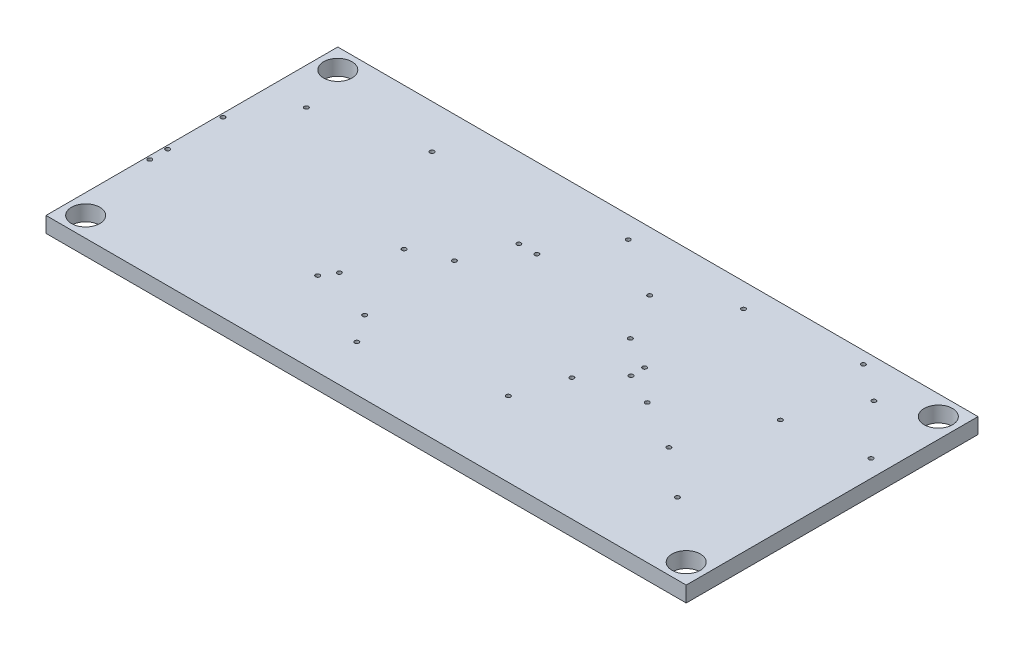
from build123d import *

# Parameters (mm, degrees)
SKETCH1_W           = 45.2
SKETCH1_H           = 20.6
BOSS_EXTRUDE1_DEPTH = 1.1
SKETCH18_R          = 1
CUT_EXTRUDE4_DEPTH  = 25.860812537
SKETCH30_R          = 0.15
CUT_EXTRUDE6_DEPTH  = 1.1


with BuildPart() as part:
    # Sketch1 → Boss-Extrude1 (new body)
    with BuildSketch(Plane(origin=(0, 0, 0), x_dir=(1, 0, 0), z_dir=(0, 1, 0))):
        Rectangle(SKETCH1_W, SKETCH1_H)
    extrude(amount=BOSS_EXTRUDE1_DEPTH)

    # Sketch18 → Cut-Extrude4 (cut, through all)
    with BuildSketch(Plane(origin=(0, 1.1, 0), x_dir=(1, 0, 0), z_dir=(0, 1, 0))):
        with Locations(Location((-21.2, -8.9, 0), (0, 0, 270))):
            Circle(SKETCH18_R)
        with Locations(Location((21.2, 8.9, 0), (0, 0, 270))):
            Circle(SKETCH18_R)
    cut_extrude4 = extrude(amount=-CUT_EXTRUDE4_DEPTH, mode=Mode.SUBTRACT)

    # Sketch30 → Cut-Extrude6 (cut)
    with BuildSketch(Plane.XZ):
        with Locations(Location((-9.333130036, 4.387708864, 0), (0, 0, 270))):
            Circle(SKETCH30_R)
        with Locations(Location((-8.744545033, 3.449056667, 0), (0, 0, 270))):
            Circle(SKETCH30_R)
        with Locations(Location((4.759894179, 5.015066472, 0), (0, 0, 270))):
            Circle(SKETCH30_R)
        with Locations(Location((16.922953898, 5.247379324, 0), (0, 0, 270))):
            Circle(SKETCH30_R)
        with Locations(Location((7.830601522, -1.527883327, 0), (0, 0, 270))):
            Circle(SKETCH30_R)
        with Locations(Location((7.85211857, -0.548857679, 0), (0, 0, 270))):
            Circle(SKETCH30_R)
        with Locations(Location((5.549794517, -2.808147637, 0), (0, 0, 270))):
            Circle(SKETCH30_R)
        with Locations(Location((5.883308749, 1.656639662, 0), (0, 0, 270))):
            Circle(SKETCH30_R)
        with Locations(Location((15.827488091, -3.115541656, 0), (0, 0, 270))):
            Circle(SKETCH30_R)
        with Locations(Location((21.375936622, -3.969149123, 0), (0, 0, 270))):
            Circle(SKETCH30_R)
        with Locations(Location((17.961506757, -7.584427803, 0), (0, 0, 270))):
            Circle(SKETCH30_R)
        with Locations(Location((15.35602841, -9.449889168, 0), (0, 0, 270))):
            Circle(SKETCH30_R)
        with Locations(Location((3.599221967, -6.119367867, 0), (0, 0, 270))):
            Circle(SKETCH30_R)
        with Locations(Location((7.740262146, -8.603991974, 0), (0, 0, 270))):
            Circle(SKETCH30_R)
        with Locations(Location((-0.570878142, -8.77835156, 0), (0, 0, 270))):
            Circle(SKETCH30_R)
        with Locations(Location((-2.901654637, -4.656320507, 0), (0, 0, 270))):
            Circle(SKETCH30_R)
        with Locations(Location((-4.176494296, -4.656320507, 0), (0, 0, 270))):
            Circle(SKETCH30_R)
        with Locations(Location((-5.415606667, -1.349023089, 0), (0, 0, 270))):
            Circle(SKETCH30_R)
        with Locations(Location((-7.901413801, -0.278896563, 0), (0, 0, 270))):
            Circle(SKETCH30_R)
        with Locations(Location((-5.254994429, 5.1458063, 0), (0, 0, 270))):
            Circle(SKETCH30_R)
        with Locations(Location((-3.895298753, 7.064281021, 0), (0, 0, 270))):
            Circle(SKETCH30_R)
        with Locations(Location((13.574528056, 2.494833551, 0), (0, 0, 270))):
            Circle(SKETCH30_R)
        with Locations(Location((10.060923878, 0.512200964, 0), (0, 0, 270))):
            Circle(SKETCH30_R)
        with Locations(Location((-12.870283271, -7.223609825, 0), (0, 0, 270))):
            Circle(SKETCH30_R)
        with Locations(Location((-20.003938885, -5.491150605, 0), (0, 0, 270))):
            Circle(SKETCH30_R)
        with Locations(Location((-22.357061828, 3.218671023, 0), (0, 0, 270))):
            Circle(SKETCH30_R)
        with Locations(Location((-22.357061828, 1.95517224, 0), (0, 0, 270))):
            Circle(SKETCH30_R)
        with Locations(Location((-22.357061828, -1.948730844, 0), (0, 0, 270))):
            Circle(SKETCH30_R)
    extrude(amount=-CUT_EXTRUDE6_DEPTH, mode=Mode.SUBTRACT)

    # Mirror1: Cut-Extrude4 across plane
    add(cut_extrude4.mirror(Plane(origin=(0, 0, 0), x_dir=(0, 0, 1), z_dir=(1, 0, 0))), mode=Mode.SUBTRACT)


solid = part.part
